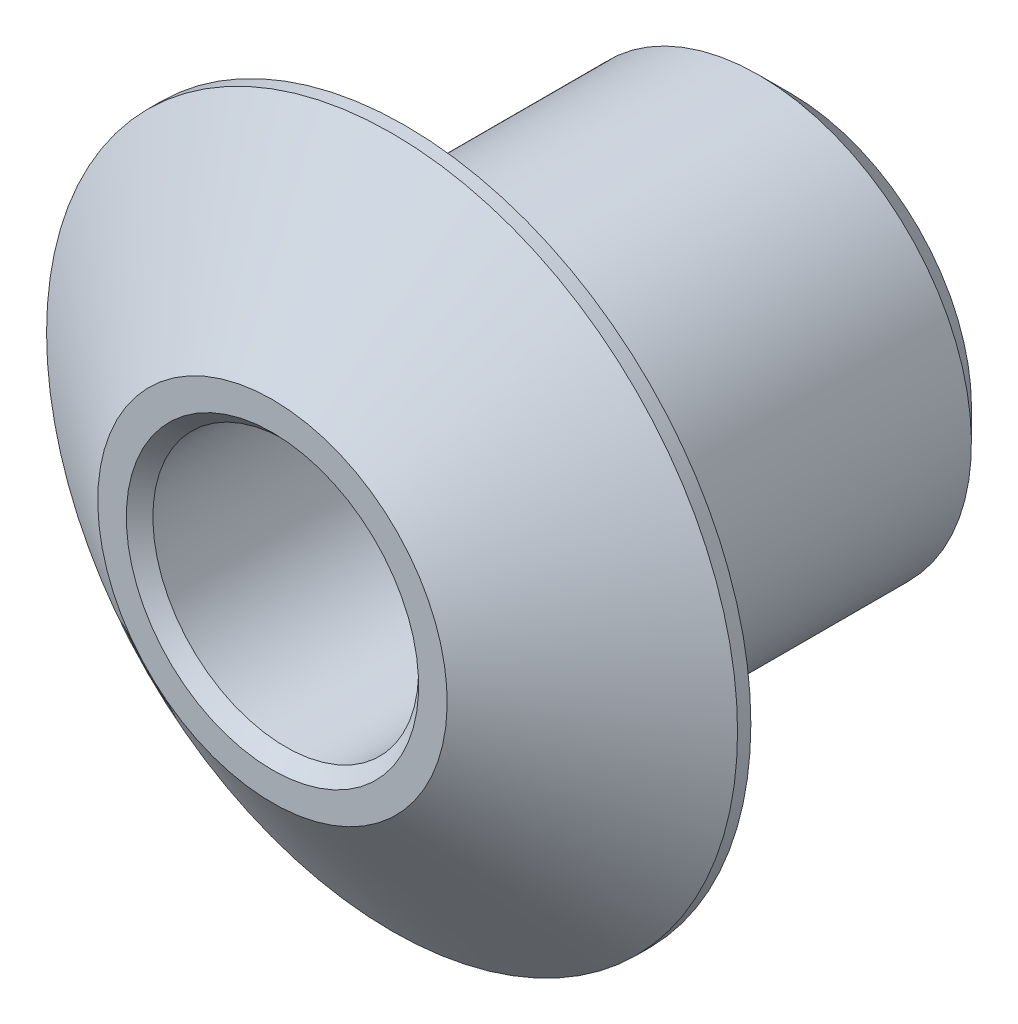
ISO-10303-21;
HEADER;
FILE_DESCRIPTION(('STEP AP214'),'2;1');
FILE_NAME('part.step','',(''),(''),'','','');
FILE_SCHEMA(('AUTOMOTIVE_DESIGN { 1 0 10303 214 1 1 1 1 }'));
ENDSEC;
DATA;
#1=APPLICATION_CONTEXT('core data for automotive mechanical design processes');
#2=APPLICATION_PROTOCOL_DEFINITION('international standard','automotive_design',2000,#1);
#3=PRODUCT_CONTEXT('',#1,'mechanical');
#4=PRODUCT('Part','Part','',(#3));
#5=PRODUCT_RELATED_PRODUCT_CATEGORY('part','',(#4));
#6=PRODUCT_DEFINITION_FORMATION('','',#4);
#7=PRODUCT_DEFINITION_CONTEXT('part definition',#1,'design');
#8=PRODUCT_DEFINITION('design','',#6,#7);
#9=PRODUCT_DEFINITION_SHAPE('','',#8);
#10=(LENGTH_UNIT() NAMED_UNIT(*) SI_UNIT(.MILLI.,.METRE.));
#11=(NAMED_UNIT(*) PLANE_ANGLE_UNIT() SI_UNIT($,.RADIAN.));
#12=(NAMED_UNIT(*) SI_UNIT($,.STERADIAN.) SOLID_ANGLE_UNIT());
#13=UNCERTAINTY_MEASURE_WITH_UNIT(LENGTH_MEASURE(1.E-05),#10,'distance_accuracy_value','');
#14=(GEOMETRIC_REPRESENTATION_CONTEXT(3) GLOBAL_UNCERTAINTY_ASSIGNED_CONTEXT((#13)) GLOBAL_UNIT_ASSIGNED_CONTEXT((#10,
#11,#12)) REPRESENTATION_CONTEXT('',''));
#15=CARTESIAN_POINT('',(0.,0.,0.));
#16=DIRECTION('',(0.,0.,1.));
#17=DIRECTION('',(1.,0.,0.));
#18=AXIS2_PLACEMENT_3D('',#15,#16,#17);
#19=CARTESIAN_POINT('',(0.,0.,-7.));
#20=DIRECTION('',(0.,0.,1.));
#21=DIRECTION('',(0.,-1.,0.));
#22=AXIS2_PLACEMENT_3D('',#19,#20,#21);
#23=CONICAL_SURFACE('',#22,5.,0.872664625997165);
#24=CARTESIAN_POINT('',(3.,4.0464525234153,-6.96875266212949));
#25=CARTESIAN_POINT('',(3.,3.943861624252,-7.03788835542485));
#26=CARTESIAN_POINT('',(3.,3.84084840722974,-7.10640722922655));
#27=CARTESIAN_POINT('',(3.,3.63378727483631,-7.24190869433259));
#28=CARTESIAN_POINT('',(3.,3.52973915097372,-7.30889096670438));
#29=CARTESIAN_POINT('',(3.,3.31973296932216,-7.44144691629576));
#30=CARTESIAN_POINT('',(3.,3.21376666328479,-7.50700756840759));
#31=CARTESIAN_POINT('',(3.,3.00042692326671,-7.63578988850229));
#32=CARTESIAN_POINT('',(3.,2.89305357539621,-7.69901169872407));
#33=CARTESIAN_POINT('',(3.,2.67034285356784,-7.82615177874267));
#34=CARTESIAN_POINT('',(3.,2.55490577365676,-7.88989628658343));
#35=CARTESIAN_POINT('',(3.,2.32181161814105,-8.01326043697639));
#36=CARTESIAN_POINT('',(3.,2.20415420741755,-8.07287945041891));
#37=CARTESIAN_POINT('',(3.,1.96658890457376,-8.18665227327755));
#38=CARTESIAN_POINT('',(3.,1.84668783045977,-8.24082019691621));
#39=CARTESIAN_POINT('',(3.,1.60405099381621,-8.34232157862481));
#40=CARTESIAN_POINT('',(3.,1.48131645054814,-8.3896579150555));
#41=CARTESIAN_POINT('',(3.,1.23700691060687,-8.47414471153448));
#42=CARTESIAN_POINT('',(3.,1.11553414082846,-8.51158654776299));
#43=CARTESIAN_POINT('',(3.,0.869873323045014,-8.57633708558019));
#44=CARTESIAN_POINT('',(3.,0.745685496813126,-8.60364661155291));
#45=CARTESIAN_POINT('',(3.,0.4976789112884,-8.64578779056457));
#46=CARTESIAN_POINT('',(3.,0.373900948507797,-8.66085433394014));
#47=CARTESIAN_POINT('',(3.,0.125441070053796,-8.67813901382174));
#48=CARTESIAN_POINT('',(3.,0.000759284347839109,-8.6803589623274));
#49=CARTESIAN_POINT('',(3.,-0.23817044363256,-8.67210650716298));
#50=CARTESIAN_POINT('',(3.,-0.352454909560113,-8.66263556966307));
#51=CARTESIAN_POINT('',(3.,-0.579674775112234,-8.63336977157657));
#52=CARTESIAN_POINT('',(3.,-0.692610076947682,-8.61357416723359));
#53=CARTESIAN_POINT('',(3.,-0.918930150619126,-8.56438741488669));
#54=CARTESIAN_POINT('',(3.,-1.03227083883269,-8.53479608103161));
#55=CARTESIAN_POINT('',(3.,-1.20045756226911,-8.48449836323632));
#56=CARTESIAN_POINT('',(3.,-1.25621437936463,-8.46674785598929));
#57=CARTESIAN_POINT('',(3.,-1.36712732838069,-8.42946413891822));
#58=CARTESIAN_POINT('',(3.,-1.42228348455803,-8.40993100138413));
#59=CARTESIAN_POINT('',(3.,-1.58327385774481,-8.35025967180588));
#60=CARTESIAN_POINT('',(3.,-1.68829635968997,-8.30792507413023));
#61=CARTESIAN_POINT('',(3.,-1.89627425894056,-8.21842229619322));
#62=CARTESIAN_POINT('',(3.,-1.99922898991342,-8.17125258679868));
#63=CARTESIAN_POINT('',(3.,-2.20337531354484,-8.07298050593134));
#64=CARTESIAN_POINT('',(3.,-2.30456482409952,-8.02187383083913));
#65=CARTESIAN_POINT('',(3.,-2.5052996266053,-7.91651745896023));
#66=CARTESIAN_POINT('',(3.,-2.60484472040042,-7.86226738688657));
#67=CARTESIAN_POINT('',(3.,-2.9025629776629,-7.69504141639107));
#68=CARTESIAN_POINT('',(3.,-3.09856819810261,-7.57821028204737));
#69=CARTESIAN_POINT('',(3.,-3.48616630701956,-7.33779148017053));
#70=CARTESIAN_POINT('',(3.,-3.67776175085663,-7.21420787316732));
#71=CARTESIAN_POINT('',(3.,-4.03717206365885,-6.97590248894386));
#72=CARTESIAN_POINT('',(3.,-4.20531388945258,-6.86167176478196));
#73=CARTESIAN_POINT('',(3.,-4.53964712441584,-6.63034388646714));
#74=CARTESIAN_POINT('',(3.,-4.70583821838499,-6.51324627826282));
#75=CARTESIAN_POINT('',(3.,-5.03443677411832,-6.27847386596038));
#76=CARTESIAN_POINT('',(3.,-5.19686504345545,-6.1608281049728));
#77=CARTESIAN_POINT('',(3.,-5.52045144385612,-5.92389056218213));
#78=CARTESIAN_POINT('',(3.,-5.68160990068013,-5.80459922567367));
#79=CARTESIAN_POINT('',(3.,-5.84229785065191,-5.68468654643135));
#80=B_SPLINE_CURVE_WITH_KNOTS('',3,(#24,#25,#26,#27,#28,#29,#30,#31,#32,#33,#34,#35,#36,#37,#38,
#39,#40,#41,#42,#43,#44,#45,#46,#47,#48,#49,#50,#51,#52,#53,#54,#55,#56,#57,#58,#59,#60,#61,#62,
#63,#64,#65,#66,#67,#68,#69,#70,#71,#72,#73,#74,#75,#76,#77,#78,#79),.UNSPECIFIED.,.F.,.F.,(4,2,
2,2,2,2,2,2,2,2,2,2,2,2,2,2,2,2,2,2,2,2,2,2,2,2,2,4),(0.,0.371141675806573,0.742359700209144,
1.11615768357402,1.48993289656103,1.88547015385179,2.28106759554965,2.67561285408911,
3.06999139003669,3.45097366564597,3.83192493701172,4.20538233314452,4.57878705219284,
4.92231074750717,5.26585919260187,5.6169131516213,5.79243134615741,5.96794242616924,
6.30747875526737,6.64712279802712,6.98714353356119,7.32720494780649,8.01151110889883,
8.69541020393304,9.3051937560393,9.91507451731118,10.5167365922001,11.1182389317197),.UNSPECIFIED.);
#81=CARTESIAN_POINT('',(3.,1.73205080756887,-8.28877176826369));
#82=VERTEX_POINT('',#81);
#83=CARTESIAN_POINT('',(3.,-1.73205080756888,-8.28877176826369));
#84=VERTEX_POINT('',#83);
#85=EDGE_CURVE('E142',#82,#84,#80,.T.);
#86=ORIENTED_EDGE('',*,*,#85,.T.);
#87=CARTESIAN_POINT('',(3.0002,-1.73193533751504,-8.28867487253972));
#88=CARTESIAN_POINT('',(2.89921414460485,-1.79023954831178,-8.33757734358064));
#89=CARTESIAN_POINT('',(2.79699863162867,-1.84925370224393,-8.38342297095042));
#90=CARTESIAN_POINT('',(2.58981898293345,-1.96886892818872,-8.46723643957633));
#91=CARTESIAN_POINT('',(2.48484701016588,-2.02947452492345,-8.50517825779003));
#92=CARTESIAN_POINT('',(2.27349304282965,-2.15149979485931,-8.57077628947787));
#93=CARTESIAN_POINT('',(2.1671327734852,-2.21290692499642,-8.59852354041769));
#94=CARTESIAN_POINT('',(1.95271281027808,-2.33670234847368,-8.64228237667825));
#95=CARTESIAN_POINT('',(1.84465535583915,-2.39908934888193,-8.65830828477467));
#96=CARTESIAN_POINT('',(1.62579316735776,-2.5254494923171,-8.67749805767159));
#97=CARTESIAN_POINT('',(1.51497312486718,-2.58943147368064,-8.68043627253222));
#98=CARTESIAN_POINT('',(1.29366302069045,-2.71720492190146,-8.6725491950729));
#99=CARTESIAN_POINT('',(1.18317312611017,-2.78099629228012,-8.66171783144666));
#100=CARTESIAN_POINT('',(0.96373776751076,-2.90768735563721,-8.62728029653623));
#101=CARTESIAN_POINT('',(0.854792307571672,-2.97058704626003,-8.60367409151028));
#102=CARTESIAN_POINT('',(0.639111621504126,-3.09511034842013,-8.54550545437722));
#103=CARTESIAN_POINT('',(0.532377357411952,-3.1567334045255,-8.51093835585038));
#104=CARTESIAN_POINT('',(0.354427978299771,-3.25947252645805,-8.4451213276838));
#105=CARTESIAN_POINT('',(0.2825455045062,-3.30097389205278,-8.41621581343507));
#106=CARTESIAN_POINT('',(0.140192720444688,-3.38316131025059,-8.35491920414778));
#107=CARTESIAN_POINT('',(0.0697182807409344,-3.42384974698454,-8.32254093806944));
#108=CARTESIAN_POINT('',(-0.000200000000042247,-3.46421708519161,-8.28867487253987));
#109=B_SPLINE_CURVE_WITH_KNOTS('',3,(#87,#88,#89,#90,#91,#92,#93,#94,#95,#96,#97,#98,#99,#100,
#101,#102,#103,#104,#105,#106,#107,#108),.UNSPECIFIED.,.F.,.F.,(4,2,2,2,2,2,2,2,2,2,4),(0.,
0.379490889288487,0.760212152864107,1.13744581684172,1.5142177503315,1.89746121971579,
2.28087372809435,2.66428724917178,3.04786422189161,3.31146149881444,3.57411651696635),.UNSPECIFIED.);
#110=CARTESIAN_POINT('',(0.,-3.46410161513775,-8.28877176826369));
#111=VERTEX_POINT('',#110);
#112=EDGE_CURVE('E104',#84,#111,#109,.T.);
#113=ORIENTED_EDGE('',*,*,#112,.T.);
#114=CARTESIAN_POINT('',(0.0002,-3.4642170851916,-8.28867487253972));
#115=CARTESIAN_POINT('',(-0.100785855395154,-3.40591287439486,-8.33757734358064));
#116=CARTESIAN_POINT('',(-0.203001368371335,-3.3468987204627,-8.38342297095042));
#117=CARTESIAN_POINT('',(-0.410181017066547,-3.22728349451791,-8.46723643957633));
#118=CARTESIAN_POINT('',(-0.51515298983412,-3.16667789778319,-8.50517825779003));
#119=CARTESIAN_POINT('',(-0.726506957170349,-3.04465262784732,-8.57077628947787));
#120=CARTESIAN_POINT('',(-0.832867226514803,-2.98324549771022,-8.59852354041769));
#121=CARTESIAN_POINT('',(-1.04728718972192,-2.85945007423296,-8.64228237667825));
#122=CARTESIAN_POINT('',(-1.15534464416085,-2.7970630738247,-8.65830828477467));
#123=CARTESIAN_POINT('',(-1.37420683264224,-2.67070293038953,-8.67749805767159));
#124=CARTESIAN_POINT('',(-1.48502687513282,-2.606720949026,-8.68043627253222));
#125=CARTESIAN_POINT('',(-1.70633697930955,-2.47894750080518,-8.67254919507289));
#126=CARTESIAN_POINT('',(-1.81682687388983,-2.41515613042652,-8.66171783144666));
#127=CARTESIAN_POINT('',(-2.03626223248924,-2.28846506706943,-8.62728029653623));
#128=CARTESIAN_POINT('',(-2.14520769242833,-2.22556537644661,-8.60367409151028));
#129=CARTESIAN_POINT('',(-2.36088837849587,-2.1010420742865,-8.54550545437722));
#130=CARTESIAN_POINT('',(-2.46762264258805,-2.03941901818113,-8.51093835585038));
#131=CARTESIAN_POINT('',(-2.64557202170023,-1.93667989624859,-8.4451213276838));
#132=CARTESIAN_POINT('',(-2.7174544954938,-1.89517853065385,-8.41621581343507));
#133=CARTESIAN_POINT('',(-2.85980727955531,-1.81299111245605,-8.35491920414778));
#134=CARTESIAN_POINT('',(-2.93028171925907,-1.7723026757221,-8.32254093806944));
#135=CARTESIAN_POINT('',(-3.00020000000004,-1.73193533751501,-8.28867487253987));
#136=B_SPLINE_CURVE_WITH_KNOTS('',3,(#114,#115,#116,#117,#118,#119,#120,#121,#122,#123,#124,
#125,#126,#127,#128,#129,#130,#131,#132,#133,#134,#135),.UNSPECIFIED.,.F.,.F.,(4,2,2,2,2,2,2,2,
2,2,4),(0.,0.379490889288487,0.760212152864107,1.13744581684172,1.5142177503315,
1.89746121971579,2.28087372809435,2.66428724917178,3.04786422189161,3.31146149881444,
3.57411651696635),.UNSPECIFIED.);
#137=CARTESIAN_POINT('',(-3.,-1.73205080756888,-8.28877176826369));
#138=VERTEX_POINT('',#137);
#139=EDGE_CURVE('E153',#111,#138,#136,.T.);
#140=ORIENTED_EDGE('',*,*,#139,.T.);
#141=CARTESIAN_POINT('',(-3.,4.0464525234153,-6.96875266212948));
#142=CARTESIAN_POINT('',(-3.,3.943861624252,-7.03788835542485));
#143=CARTESIAN_POINT('',(-3.,3.84084840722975,-7.10640722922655));
#144=CARTESIAN_POINT('',(-3.,3.63378727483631,-7.24190869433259));
#145=CARTESIAN_POINT('',(-3.,3.52973915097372,-7.30889096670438));
#146=CARTESIAN_POINT('',(-3.,3.31973296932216,-7.44144691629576));
#147=CARTESIAN_POINT('',(-3.,3.21376666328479,-7.50700756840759));
#148=CARTESIAN_POINT('',(-3.,3.00042692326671,-7.63578988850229));
#149=CARTESIAN_POINT('',(-3.,2.89305357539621,-7.69901169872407));
#150=CARTESIAN_POINT('',(-3.,2.67034285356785,-7.82615177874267));
#151=CARTESIAN_POINT('',(-3.,2.55490577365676,-7.88989628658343));
#152=CARTESIAN_POINT('',(-3.,2.32181161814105,-8.01326043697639));
#153=CARTESIAN_POINT('',(-3.,2.20415420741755,-8.07287945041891));
#154=CARTESIAN_POINT('',(-3.,1.96658890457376,-8.18665227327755));
#155=CARTESIAN_POINT('',(-3.,1.84668783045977,-8.24082019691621));
#156=CARTESIAN_POINT('',(-3.,1.60405099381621,-8.34232157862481));
#157=CARTESIAN_POINT('',(-3.,1.48131645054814,-8.3896579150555));
#158=CARTESIAN_POINT('',(-3.,1.23700691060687,-8.47414471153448));
#159=CARTESIAN_POINT('',(-3.,1.11553414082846,-8.51158654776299));
#160=CARTESIAN_POINT('',(-3.,0.869873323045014,-8.57633708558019));
#161=CARTESIAN_POINT('',(-3.,0.745685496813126,-8.60364661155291));
#162=CARTESIAN_POINT('',(-3.,0.497678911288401,-8.64578779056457));
#163=CARTESIAN_POINT('',(-3.,0.373900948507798,-8.66085433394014));
#164=CARTESIAN_POINT('',(-3.,0.125441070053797,-8.67813901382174));
#165=CARTESIAN_POINT('',(-3.,0.000759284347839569,-8.6803589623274));
#166=CARTESIAN_POINT('',(-3.,-0.23817044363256,-8.67210650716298));
#167=CARTESIAN_POINT('',(-3.,-0.352454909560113,-8.66263556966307));
#168=CARTESIAN_POINT('',(-3.,-0.579674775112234,-8.63336977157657));
#169=CARTESIAN_POINT('',(-3.,-0.692610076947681,-8.61357416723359));
#170=CARTESIAN_POINT('',(-3.,-0.918930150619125,-8.56438741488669));
#171=CARTESIAN_POINT('',(-3.,-1.03227083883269,-8.53479608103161));
#172=CARTESIAN_POINT('',(-3.,-1.20045756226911,-8.48449836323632));
#173=CARTESIAN_POINT('',(-3.,-1.25621437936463,-8.46674785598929));
#174=CARTESIAN_POINT('',(-3.,-1.36712732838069,-8.42946413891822));
#175=CARTESIAN_POINT('',(-3.,-1.42228348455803,-8.40993100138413));
#176=CARTESIAN_POINT('',(-3.,-1.58327385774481,-8.35025967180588));
#177=CARTESIAN_POINT('',(-3.,-1.68829635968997,-8.30792507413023));
#178=CARTESIAN_POINT('',(-3.,-1.89627425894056,-8.21842229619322));
#179=CARTESIAN_POINT('',(-3.,-1.99922898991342,-8.17125258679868));
#180=CARTESIAN_POINT('',(-3.,-2.20337531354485,-8.07298050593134));
#181=CARTESIAN_POINT('',(-3.,-2.30456482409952,-8.02187383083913));
#182=CARTESIAN_POINT('',(-3.,-2.5052996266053,-7.91651745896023));
#183=CARTESIAN_POINT('',(-3.,-2.60484472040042,-7.86226738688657));
#184=CARTESIAN_POINT('',(-3.,-2.9025629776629,-7.69504141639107));
#185=CARTESIAN_POINT('',(-3.,-3.09856819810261,-7.57821028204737));
#186=CARTESIAN_POINT('',(-3.,-3.48616630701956,-7.33779148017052));
#187=CARTESIAN_POINT('',(-3.,-3.67776175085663,-7.21420787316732));
#188=CARTESIAN_POINT('',(-3.,-4.03717206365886,-6.97590248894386));
#189=CARTESIAN_POINT('',(-3.,-4.20531388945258,-6.86167176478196));
#190=CARTESIAN_POINT('',(-3.,-4.53964712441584,-6.63034388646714));
#191=CARTESIAN_POINT('',(-3.,-4.70583821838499,-6.51324627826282));
#192=CARTESIAN_POINT('',(-3.,-5.03443677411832,-6.27847386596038));
#193=CARTESIAN_POINT('',(-3.,-5.19686504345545,-6.1608281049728));
#194=CARTESIAN_POINT('',(-3.,-5.52045144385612,-5.92389056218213));
#195=CARTESIAN_POINT('',(-3.,-5.68160990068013,-5.80459922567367));
#196=CARTESIAN_POINT('',(-3.,-5.84229785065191,-5.68468654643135));
#197=B_SPLINE_CURVE_WITH_KNOTS('',3,(#141,#142,#143,#144,#145,#146,#147,#148,#149,#150,#151,
#152,#153,#154,#155,#156,#157,#158,#159,#160,#161,#162,#163,#164,#165,#166,#167,#168,#169,#170,
#171,#172,#173,#174,#175,#176,#177,#178,#179,#180,#181,#182,#183,#184,#185,#186,#187,#188,#189,
#190,#191,#192,#193,#194,#195,#196),.UNSPECIFIED.,.F.,.F.,(4,2,2,2,2,2,2,2,2,2,2,2,2,2,2,2,2,2,
2,2,2,2,2,2,2,2,2,4),(0.,0.371141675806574,0.742359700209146,1.11615768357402,1.48993289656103,
1.88547015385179,2.28106759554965,2.67561285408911,3.0699913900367,3.45097366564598,
3.83192493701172,4.20538233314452,4.57878705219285,4.92231074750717,5.26585919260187,
5.6169131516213,5.79243134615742,5.96794242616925,6.30747875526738,6.64712279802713,
6.9871435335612,7.3272049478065,8.01151110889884,8.69541020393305,9.30519375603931,
9.91507451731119,10.5167365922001,11.1182389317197),.UNSPECIFIED.);
#198=CARTESIAN_POINT('',(-3.,1.73205080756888,-8.28877176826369));
#199=VERTEX_POINT('',#198);
#200=EDGE_CURVE('E78',#138,#199,#197,.F.);
#201=ORIENTED_EDGE('',*,*,#200,.T.);
#202=CARTESIAN_POINT('',(-3.0002,1.73193533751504,-8.28867487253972));
#203=CARTESIAN_POINT('',(-2.89921414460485,1.79023954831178,-8.33757734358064));
#204=CARTESIAN_POINT('',(-2.79699863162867,1.84925370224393,-8.38342297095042));
#205=CARTESIAN_POINT('',(-2.58981898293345,1.96886892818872,-8.46723643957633));
#206=CARTESIAN_POINT('',(-2.48484701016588,2.02947452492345,-8.50517825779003));
#207=CARTESIAN_POINT('',(-2.27349304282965,2.15149979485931,-8.57077628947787));
#208=CARTESIAN_POINT('',(-2.1671327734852,2.21290692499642,-8.59852354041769));
#209=CARTESIAN_POINT('',(-1.95271281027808,2.33670234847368,-8.64228237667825));
#210=CARTESIAN_POINT('',(-1.84465535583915,2.39908934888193,-8.65830828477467));
#211=CARTESIAN_POINT('',(-1.62579316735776,2.5254494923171,-8.67749805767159));
#212=CARTESIAN_POINT('',(-1.51497312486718,2.58943147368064,-8.68043627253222));
#213=CARTESIAN_POINT('',(-1.29366302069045,2.71720492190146,-8.6725491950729));
#214=CARTESIAN_POINT('',(-1.18317312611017,2.78099629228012,-8.66171783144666));
#215=CARTESIAN_POINT('',(-0.96373776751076,2.90768735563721,-8.62728029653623));
#216=CARTESIAN_POINT('',(-0.854792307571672,2.97058704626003,-8.60367409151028));
#217=CARTESIAN_POINT('',(-0.639111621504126,3.09511034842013,-8.54550545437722));
#218=CARTESIAN_POINT('',(-0.532377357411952,3.1567334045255,-8.51093835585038));
#219=CARTESIAN_POINT('',(-0.354427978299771,3.25947252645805,-8.4451213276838));
#220=CARTESIAN_POINT('',(-0.2825455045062,3.30097389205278,-8.41621581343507));
#221=CARTESIAN_POINT('',(-0.140192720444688,3.38316131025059,-8.35491920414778));
#222=CARTESIAN_POINT('',(-0.0697182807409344,3.42384974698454,-8.32254093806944));
#223=CARTESIAN_POINT('',(0.000200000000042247,3.46421708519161,-8.28867487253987));
#224=B_SPLINE_CURVE_WITH_KNOTS('',3,(#202,#203,#204,#205,#206,#207,#208,#209,#210,#211,#212,
#213,#214,#215,#216,#217,#218,#219,#220,#221,#222,#223),.UNSPECIFIED.,.F.,.F.,(4,2,2,2,2,2,2,2,
2,2,4),(0.,0.379490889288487,0.760212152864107,1.13744581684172,1.5142177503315,
1.89746121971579,2.28087372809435,2.66428724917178,3.04786422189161,3.31146149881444,
3.57411651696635),.UNSPECIFIED.);
#225=CARTESIAN_POINT('',(0.,3.46410161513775,-8.28877176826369));
#226=VERTEX_POINT('',#225);
#227=EDGE_CURVE('E29',#199,#226,#224,.T.);
#228=ORIENTED_EDGE('',*,*,#227,.T.);
#229=CARTESIAN_POINT('',(-0.0002,3.4642170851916,-8.28867487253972));
#230=CARTESIAN_POINT('',(0.100785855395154,3.40591287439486,-8.33757734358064));
#231=CARTESIAN_POINT('',(0.203001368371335,3.3468987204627,-8.38342297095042));
#232=CARTESIAN_POINT('',(0.410181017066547,3.22728349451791,-8.46723643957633));
#233=CARTESIAN_POINT('',(0.51515298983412,3.16667789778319,-8.50517825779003));
#234=CARTESIAN_POINT('',(0.726506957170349,3.04465262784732,-8.57077628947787));
#235=CARTESIAN_POINT('',(0.832867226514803,2.98324549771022,-8.59852354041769));
#236=CARTESIAN_POINT('',(1.04728718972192,2.85945007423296,-8.64228237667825));
#237=CARTESIAN_POINT('',(1.15534464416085,2.7970630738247,-8.65830828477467));
#238=CARTESIAN_POINT('',(1.37420683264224,2.67070293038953,-8.67749805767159));
#239=CARTESIAN_POINT('',(1.48502687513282,2.606720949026,-8.68043627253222));
#240=CARTESIAN_POINT('',(1.70633697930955,2.47894750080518,-8.67254919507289));
#241=CARTESIAN_POINT('',(1.81682687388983,2.41515613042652,-8.66171783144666));
#242=CARTESIAN_POINT('',(2.03626223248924,2.28846506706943,-8.62728029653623));
#243=CARTESIAN_POINT('',(2.14520769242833,2.22556537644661,-8.60367409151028));
#244=CARTESIAN_POINT('',(2.36088837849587,2.1010420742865,-8.54550545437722));
#245=CARTESIAN_POINT('',(2.46762264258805,2.03941901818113,-8.51093835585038));
#246=CARTESIAN_POINT('',(2.64557202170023,1.93667989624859,-8.4451213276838));
#247=CARTESIAN_POINT('',(2.7174544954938,1.89517853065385,-8.41621581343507));
#248=CARTESIAN_POINT('',(2.85980727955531,1.81299111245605,-8.35491920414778));
#249=CARTESIAN_POINT('',(2.93028171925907,1.7723026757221,-8.32254093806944));
#250=CARTESIAN_POINT('',(3.00020000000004,1.73193533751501,-8.28867487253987));
#251=B_SPLINE_CURVE_WITH_KNOTS('',3,(#229,#230,#231,#232,#233,#234,#235,#236,#237,#238,#239,
#240,#241,#242,#243,#244,#245,#246,#247,#248,#249,#250),.UNSPECIFIED.,.F.,.F.,(4,2,2,2,2,2,2,2,
2,2,4),(0.,0.379490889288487,0.760212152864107,1.13744581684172,1.5142177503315,
1.89746121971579,2.28087372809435,2.66428724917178,3.04786422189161,3.31146149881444,
3.57411651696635),.UNSPECIFIED.);
#252=EDGE_CURVE('E121',#226,#82,#251,.T.);
#253=ORIENTED_EDGE('',*,*,#252,.T.);
#254=EDGE_LOOP('',(#86,#113,#140,#201,#228,#253));
#255=FACE_BOUND('',#254,.T.);
#256=CARTESIAN_POINT('',(0.,0.,-7.));
#257=DIRECTION('',(0.,0.,-1.));
#258=DIRECTION('',(0.,1.,0.));
#259=AXIS2_PLACEMENT_3D('',#256,#257,#258);
#260=CIRCLE('',#259,5.);
#261=CARTESIAN_POINT('',(0.,5.,-7.));
#262=VERTEX_POINT('',#261);
#263=EDGE_CURVE('E214',#262,#262,#260,.T.);
#264=ORIENTED_EDGE('',*,*,#263,.F.);
#265=EDGE_LOOP('',(#264));
#266=FACE_BOUND('',#265,.T.);
#267=ADVANCED_FACE('F14',(#255,#266),#23,.F.);
#268=CARTESIAN_POINT('',(3.,0.,-14.5));
#269=DIRECTION('',(0.,0.,-1.));
#270=DIRECTION('',(0.,1.,0.));
#271=AXIS2_PLACEMENT_3D('',#268,#269,#270);
#272=PLANE('',#271);
#273=CARTESIAN_POINT('',(0.,0.,-14.5));
#274=DIRECTION('',(0.,0.,-1.));
#275=DIRECTION('',(0.,1.,0.));
#276=AXIS2_PLACEMENT_3D('',#273,#274,#275);
#277=CIRCLE('',#276,6.8);
#278=CARTESIAN_POINT('',(0.,6.8,-14.5));
#279=VERTEX_POINT('',#278);
#280=EDGE_CURVE('E88',#279,#279,#277,.T.);
#281=ORIENTED_EDGE('',*,*,#280,.T.);
#282=EDGE_LOOP('',(#281));
#283=FACE_BOUND('',#282,.T.);
#284=DIRECTION('',(-0.866025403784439,-0.5,0.));
#285=VECTOR('',#284,1.);
#286=CARTESIAN_POINT('',(0.75,3.89711431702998,-14.5));
#287=LINE('',#286,#285);
#288=CARTESIAN_POINT('',(0.,3.46410161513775,-14.5));
#289=VERTEX_POINT('',#288);
#290=CARTESIAN_POINT('',(-3.,1.73205080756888,-14.5));
#291=VERTEX_POINT('',#290);
#292=EDGE_CURVE('E83',#289,#291,#287,.T.);
#293=ORIENTED_EDGE('',*,*,#292,.T.);
#294=DIRECTION('',(0.,-1.,0.));
#295=VECTOR('',#294,1.);
#296=CARTESIAN_POINT('',(-3.,0.,-14.5));
#297=LINE('',#296,#295);
#298=CARTESIAN_POINT('',(-3.,-1.73205080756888,-14.5));
#299=VERTEX_POINT('',#298);
#300=EDGE_CURVE('E9',#291,#299,#297,.T.);
#301=ORIENTED_EDGE('',*,*,#300,.T.);
#302=DIRECTION('',(0.866025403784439,-0.5,0.));
#303=VECTOR('',#302,1.);
#304=CARTESIAN_POINT('',(0.75,-3.89711431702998,-14.5));
#305=LINE('',#304,#303);
#306=CARTESIAN_POINT('',(0.,-3.46410161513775,-14.5));
#307=VERTEX_POINT('',#306);
#308=EDGE_CURVE('E22',#299,#307,#305,.T.);
#309=ORIENTED_EDGE('',*,*,#308,.T.);
#310=DIRECTION('',(0.866025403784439,0.5,0.));
#311=VECTOR('',#310,1.);
#312=CARTESIAN_POINT('',(3.75,-1.29903810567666,-14.5));
#313=LINE('',#312,#311);
#314=CARTESIAN_POINT('',(3.,-1.73205080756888,-14.5));
#315=VERTEX_POINT('',#314);
#316=EDGE_CURVE('E75',#307,#315,#313,.T.);
#317=ORIENTED_EDGE('',*,*,#316,.T.);
#318=DIRECTION('',(0.,1.,0.));
#319=VECTOR('',#318,1.);
#320=CARTESIAN_POINT('',(3.,0.,-14.5));
#321=LINE('',#320,#319);
#322=CARTESIAN_POINT('',(3.,1.73205080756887,-14.5));
#323=VERTEX_POINT('',#322);
#324=EDGE_CURVE('E90',#315,#323,#321,.T.);
#325=ORIENTED_EDGE('',*,*,#324,.T.);
#326=DIRECTION('',(-0.866025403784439,0.5,0.));
#327=VECTOR('',#326,1.);
#328=CARTESIAN_POINT('',(3.75,1.29903810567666,-14.5));
#329=LINE('',#328,#327);
#330=EDGE_CURVE('E85',#323,#289,#329,.T.);
#331=ORIENTED_EDGE('',*,*,#330,.T.);
#332=EDGE_LOOP('',(#293,#301,#309,#317,#325,#331));
#333=FACE_BOUND('',#332,.T.);
#334=ADVANCED_FACE('F81',(#283,#333),#272,.T.);
#335=CARTESIAN_POINT('',(0.,0.,-14.5));
#336=DIRECTION('',(0.,0.,1.));
#337=DIRECTION('',(0.,-1.,0.));
#338=AXIS2_PLACEMENT_3D('',#335,#336,#337);
#339=CONICAL_SURFACE('',#338,6.8,0.785398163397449);
#340=CARTESIAN_POINT('',(0.,0.,-13.3));
#341=DIRECTION('',(0.,0.,-1.));
#342=DIRECTION('',(0.,1.,0.));
#343=AXIS2_PLACEMENT_3D('',#340,#341,#342);
#344=CIRCLE('',#343,8.);
#345=CARTESIAN_POINT('',(0.,8.,-13.3));
#346=VERTEX_POINT('',#345);
#347=EDGE_CURVE('E93',#346,#346,#344,.T.);
#348=ORIENTED_EDGE('',*,*,#347,.T.);
#349=EDGE_LOOP('',(#348));
#350=FACE_BOUND('',#349,.T.);
#351=ORIENTED_EDGE('',*,*,#280,.F.);
#352=EDGE_LOOP('',(#351));
#353=FACE_BOUND('',#352,.T.);
#354=ADVANCED_FACE('F197',(#350,#353),#339,.T.);
#355=CARTESIAN_POINT('',(0.,0.,-14.5));
#356=DIRECTION('',(0.,0.,-1.));
#357=DIRECTION('',(0.,1.,0.));
#358=AXIS2_PLACEMENT_3D('',#355,#356,#357);
#359=CYLINDRICAL_SURFACE('',#358,8.);
#360=CARTESIAN_POINT('',(0.,0.,0.));
#361=DIRECTION('',(0.,0.,-1.));
#362=DIRECTION('',(0.,1.,0.));
#363=AXIS2_PLACEMENT_3D('',#360,#361,#362);
#364=CIRCLE('',#363,8.);
#365=CARTESIAN_POINT('',(0.,8.,0.));
#366=VERTEX_POINT('',#365);
#367=EDGE_CURVE('E231',#366,#366,#364,.T.);
#368=ORIENTED_EDGE('',*,*,#367,.T.);
#369=EDGE_LOOP('',(#368));
#370=FACE_BOUND('',#369,.T.);
#371=ORIENTED_EDGE('',*,*,#347,.F.);
#372=EDGE_LOOP('',(#371));
#373=FACE_BOUND('',#372,.T.);
#374=ADVANCED_FACE('F193',(#370,#373),#359,.T.);
#375=CARTESIAN_POINT('',(8.,0.,0.));
#376=DIRECTION('',(0.,0.,-1.));
#377=DIRECTION('',(0.,1.,0.));
#378=AXIS2_PLACEMENT_3D('',#375,#376,#377);
#379=PLANE('',#378);
#380=CARTESIAN_POINT('',(0.,0.,0.));
#381=DIRECTION('',(0.,0.,-1.));
#382=DIRECTION('',(0.,1.,0.));
#383=AXIS2_PLACEMENT_3D('',#380,#381,#382);
#384=CIRCLE('',#383,13.);
#385=CARTESIAN_POINT('',(0.,13.,0.));
#386=VERTEX_POINT('',#385);
#387=EDGE_CURVE('E228',#386,#386,#384,.T.);
#388=ORIENTED_EDGE('',*,*,#387,.T.);
#389=EDGE_LOOP('',(#388));
#390=FACE_BOUND('',#389,.T.);
#391=ORIENTED_EDGE('',*,*,#367,.F.);
#392=EDGE_LOOP('',(#391));
#393=FACE_BOUND('',#392,.T.);
#394=ADVANCED_FACE('F189',(#390,#393),#379,.T.);
#395=CARTESIAN_POINT('',(0.,0.,-14.5));
#396=DIRECTION('',(0.,0.,-1.));
#397=DIRECTION('',(0.,1.,0.));
#398=AXIS2_PLACEMENT_3D('',#395,#396,#397);
#399=CYLINDRICAL_SURFACE('',#398,13.);
#400=CARTESIAN_POINT('',(0.,0.,0.5));
#401=DIRECTION('',(0.,0.,-1.));
#402=DIRECTION('',(0.,1.,0.));
#403=AXIS2_PLACEMENT_3D('',#400,#401,#402);
#404=CIRCLE('',#403,13.);
#405=CARTESIAN_POINT('',(0.,13.,0.5));
#406=VERTEX_POINT('',#405);
#407=EDGE_CURVE('E225',#406,#406,#404,.T.);
#408=ORIENTED_EDGE('',*,*,#407,.T.);
#409=EDGE_LOOP('',(#408));
#410=FACE_BOUND('',#409,.T.);
#411=ORIENTED_EDGE('',*,*,#387,.F.);
#412=EDGE_LOOP('',(#411));
#413=FACE_BOUND('',#412,.T.);
#414=ADVANCED_FACE('F185',(#410,#413),#399,.T.);
#415=CARTESIAN_POINT('',(0.,0.,0.5));
#416=DIRECTION('',(0.,0.,-1.));
#417=DIRECTION('',(0.,1.,0.));
#418=AXIS2_PLACEMENT_3D('',#415,#416,#417);
#419=CONICAL_SURFACE('',#418,13.,0.959931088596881);
#420=CARTESIAN_POINT('',(0.,0.,5.));
#421=DIRECTION('',(0.,0.,-1.));
#422=DIRECTION('',(0.,1.,0.));
#423=AXIS2_PLACEMENT_3D('',#420,#421,#422);
#424=CIRCLE('',#423,6.57333396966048);
#425=CARTESIAN_POINT('',(0.,6.57333396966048,5.));
#426=VERTEX_POINT('',#425);
#427=EDGE_CURVE('E222',#426,#426,#424,.T.);
#428=ORIENTED_EDGE('',*,*,#427,.T.);
#429=EDGE_LOOP('',(#428));
#430=FACE_BOUND('',#429,.T.);
#431=ORIENTED_EDGE('',*,*,#407,.F.);
#432=EDGE_LOOP('',(#431));
#433=FACE_BOUND('',#432,.T.);
#434=ADVANCED_FACE('F181',(#430,#433),#419,.T.);
#435=CARTESIAN_POINT('',(6.57333396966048,0.,5.));
#436=DIRECTION('',(0.,0.,1.));
#437=DIRECTION('',(0.,-1.,0.));
#438=AXIS2_PLACEMENT_3D('',#435,#436,#437);
#439=PLANE('',#438);
#440=CARTESIAN_POINT('',(0.,0.,5.));
#441=DIRECTION('',(0.,0.,-1.));
#442=DIRECTION('',(0.,1.,0.));
#443=AXIS2_PLACEMENT_3D('',#440,#441,#442);
#444=CIRCLE('',#443,5.5);
#445=CARTESIAN_POINT('',(0.,5.5,5.));
#446=VERTEX_POINT('',#445);
#447=EDGE_CURVE('E217',#446,#446,#444,.T.);
#448=ORIENTED_EDGE('',*,*,#447,.T.);
#449=EDGE_LOOP('',(#448));
#450=FACE_BOUND('',#449,.T.);
#451=ORIENTED_EDGE('',*,*,#427,.F.);
#452=EDGE_LOOP('',(#451));
#453=FACE_BOUND('',#452,.T.);
#454=ADVANCED_FACE('F177',(#450,#453),#439,.T.);
#455=CARTESIAN_POINT('',(0.,0.,5.));
#456=DIRECTION('',(0.,0.,1.));
#457=DIRECTION('',(0.,-1.,0.));
#458=AXIS2_PLACEMENT_3D('',#455,#456,#457);
#459=CONICAL_SURFACE('',#458,5.5,0.785398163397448);
#460=CARTESIAN_POINT('',(0.,0.,4.5));
#461=DIRECTION('',(0.,0.,-1.));
#462=DIRECTION('',(0.,1.,0.));
#463=AXIS2_PLACEMENT_3D('',#460,#461,#462);
#464=CIRCLE('',#463,5.);
#465=CARTESIAN_POINT('',(0.,5.,4.5));
#466=VERTEX_POINT('',#465);
#467=EDGE_CURVE('E215',#466,#466,#464,.T.);
#468=ORIENTED_EDGE('',*,*,#467,.T.);
#469=EDGE_LOOP('',(#468));
#470=FACE_BOUND('',#469,.T.);
#471=ORIENTED_EDGE('',*,*,#447,.F.);
#472=EDGE_LOOP('',(#471));
#473=FACE_BOUND('',#472,.T.);
#474=ADVANCED_FACE('F173',(#470,#473),#459,.F.);
#475=CARTESIAN_POINT('',(0.,0.,-14.5));
#476=DIRECTION('',(0.,0.,-1.));
#477=DIRECTION('',(0.,1.,0.));
#478=AXIS2_PLACEMENT_3D('',#475,#476,#477);
#479=CYLINDRICAL_SURFACE('',#478,5.);
#480=ORIENTED_EDGE('',*,*,#263,.T.);
#481=EDGE_LOOP('',(#480));
#482=FACE_BOUND('',#481,.T.);
#483=ORIENTED_EDGE('',*,*,#467,.F.);
#484=EDGE_LOOP('',(#483));
#485=FACE_BOUND('',#484,.T.);
#486=ADVANCED_FACE('F170',(#482,#485),#479,.F.);
#487=CARTESIAN_POINT('',(-3.,1.73205080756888,-7.));
#488=DIRECTION('',(1.,0.,0.));
#489=DIRECTION('',(0.,1.,0.));
#490=AXIS2_PLACEMENT_3D('',#487,#488,#489);
#491=PLANE('',#490);
#492=DIRECTION('',(0.,0.,-1.));
#493=VECTOR('',#492,1.);
#494=CARTESIAN_POINT('',(-3.,-1.73205080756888,-7.));
#495=LINE('',#494,#493);
#496=EDGE_CURVE('E70',#138,#299,#495,.T.);
#497=ORIENTED_EDGE('',*,*,#496,.T.);
#498=ORIENTED_EDGE('',*,*,#300,.F.);
#499=DIRECTION('',(0.,0.,-1.));
#500=VECTOR('',#499,1.);
#501=CARTESIAN_POINT('',(-3.,1.73205080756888,-7.));
#502=LINE('',#501,#500);
#503=EDGE_CURVE('E246',#199,#291,#502,.T.);
#504=ORIENTED_EDGE('',*,*,#503,.F.);
#505=ORIENTED_EDGE('',*,*,#200,.F.);
#506=EDGE_LOOP('',(#497,#498,#504,#505));
#507=FACE_BOUND('',#506,.T.);
#508=ADVANCED_FACE('F77',(#507),#491,.T.);
#509=CARTESIAN_POINT('',(-3.,-1.73205080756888,-7.));
#510=DIRECTION('',(0.5,0.866025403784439,0.));
#511=DIRECTION('',(-0.866025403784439,0.5,0.));
#512=AXIS2_PLACEMENT_3D('',#509,#510,#511);
#513=PLANE('',#512);
#514=DIRECTION('',(0.,0.,-1.));
#515=VECTOR('',#514,1.);
#516=CARTESIAN_POINT('',(0.,-3.46410161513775,-7.));
#517=LINE('',#516,#515);
#518=EDGE_CURVE('E72',#111,#307,#517,.T.);
#519=ORIENTED_EDGE('',*,*,#518,.T.);
#520=ORIENTED_EDGE('',*,*,#308,.F.);
#521=ORIENTED_EDGE('',*,*,#496,.F.);
#522=ORIENTED_EDGE('',*,*,#139,.F.);
#523=EDGE_LOOP('',(#519,#520,#521,#522));
#524=FACE_BOUND('',#523,.T.);
#525=ADVANCED_FACE('F68',(#524),#513,.T.);
#526=CARTESIAN_POINT('',(0.,-3.46410161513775,-7.));
#527=DIRECTION('',(-0.5,0.866025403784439,0.));
#528=DIRECTION('',(-0.866025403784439,-0.5,0.));
#529=AXIS2_PLACEMENT_3D('',#526,#527,#528);
#530=PLANE('',#529);
#531=DIRECTION('',(0.,0.,-1.));
#532=VECTOR('',#531,1.);
#533=CARTESIAN_POINT('',(3.,-1.73205080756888,-7.));
#534=LINE('',#533,#532);
#535=EDGE_CURVE('E103',#84,#315,#534,.T.);
#536=ORIENTED_EDGE('',*,*,#535,.T.);
#537=ORIENTED_EDGE('',*,*,#316,.F.);
#538=ORIENTED_EDGE('',*,*,#518,.F.);
#539=ORIENTED_EDGE('',*,*,#112,.F.);
#540=EDGE_LOOP('',(#536,#537,#538,#539));
#541=FACE_BOUND('',#540,.T.);
#542=ADVANCED_FACE('F100',(#541),#530,.T.);
#543=CARTESIAN_POINT('',(3.,-1.73205080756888,-7.));
#544=DIRECTION('',(-1.,0.,0.));
#545=DIRECTION('',(0.,-1.,0.));
#546=AXIS2_PLACEMENT_3D('',#543,#544,#545);
#547=PLANE('',#546);
#548=DIRECTION('',(0.,0.,-1.));
#549=VECTOR('',#548,1.);
#550=CARTESIAN_POINT('',(3.,1.73205080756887,-7.));
#551=LINE('',#550,#549);
#552=EDGE_CURVE('E107',#82,#323,#551,.T.);
#553=ORIENTED_EDGE('',*,*,#552,.T.);
#554=ORIENTED_EDGE('',*,*,#324,.F.);
#555=ORIENTED_EDGE('',*,*,#535,.F.);
#556=ORIENTED_EDGE('',*,*,#85,.F.);
#557=EDGE_LOOP('',(#553,#554,#555,#556));
#558=FACE_BOUND('',#557,.T.);
#559=ADVANCED_FACE('F135',(#558),#547,.T.);
#560=CARTESIAN_POINT('',(3.,1.73205080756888,-7.));
#561=DIRECTION('',(-0.5,-0.866025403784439,0.));
#562=DIRECTION('',(0.866025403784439,-0.5,0.));
#563=AXIS2_PLACEMENT_3D('',#560,#561,#562);
#564=PLANE('',#563);
#565=DIRECTION('',(0.,0.,-1.));
#566=VECTOR('',#565,1.);
#567=CARTESIAN_POINT('',(0.,3.46410161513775,-7.));
#568=LINE('',#567,#566);
#569=EDGE_CURVE('E111',#226,#289,#568,.T.);
#570=ORIENTED_EDGE('',*,*,#569,.T.);
#571=ORIENTED_EDGE('',*,*,#330,.F.);
#572=ORIENTED_EDGE('',*,*,#552,.F.);
#573=ORIENTED_EDGE('',*,*,#252,.F.);
#574=EDGE_LOOP('',(#570,#571,#572,#573));
#575=FACE_BOUND('',#574,.T.);
#576=ADVANCED_FACE('F131',(#575),#564,.T.);
#577=CARTESIAN_POINT('',(0.,3.46410161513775,-7.));
#578=DIRECTION('',(0.5,-0.866025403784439,0.));
#579=DIRECTION('',(0.866025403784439,0.5,0.));
#580=AXIS2_PLACEMENT_3D('',#577,#578,#579);
#581=PLANE('',#580);
#582=ORIENTED_EDGE('',*,*,#503,.T.);
#583=ORIENTED_EDGE('',*,*,#292,.F.);
#584=ORIENTED_EDGE('',*,*,#569,.F.);
#585=ORIENTED_EDGE('',*,*,#227,.F.);
#586=EDGE_LOOP('',(#582,#583,#584,#585));
#587=FACE_BOUND('',#586,.T.);
#588=ADVANCED_FACE('F128',(#587),#581,.T.);
#589=CLOSED_SHELL('',(#267,#334,#354,#374,#394,#414,#434,#454,#474,#486,#508,#525,#542,#559,
#576,#588));
#590=MANIFOLD_SOLID_BREP('B1',#589);
#591=ADVANCED_BREP_SHAPE_REPRESENTATION('',(#18,#590),#14);
#592=SHAPE_DEFINITION_REPRESENTATION(#9,#591);
ENDSEC;
END-ISO-10303-21;
